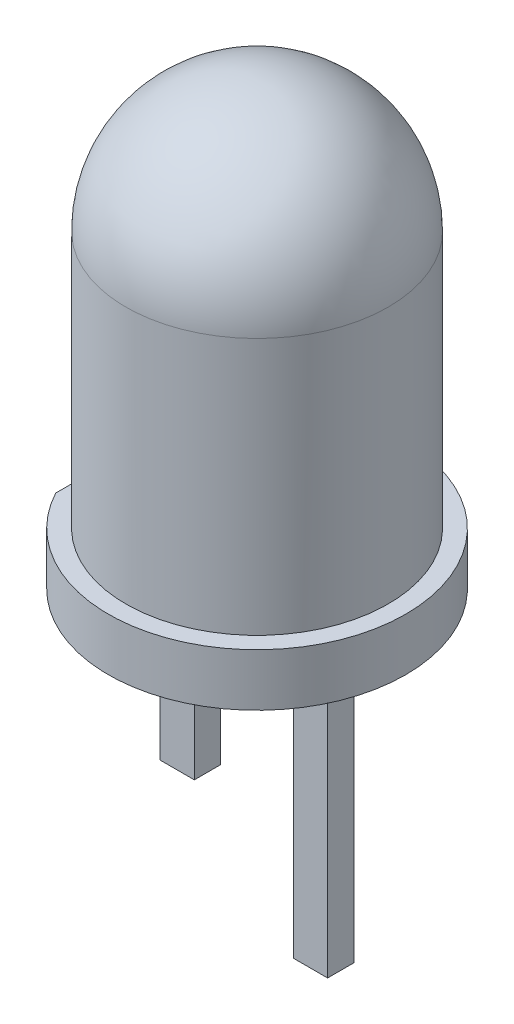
from build123d import *

# Parameters (mm, degrees)
ESQUISSE2_W             = 1.299065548
ESQUISSE2_H             = 1
ENL_V_MAT_EXTRU_1_DEPTH = 5
ESQUISSE3_W             = 0.65
ESQUISSE3_H             = 0.5
EXTRUSION1_DEPTH        = 5.5
EXTRUSION3_DEPTH        = 0.25
EXTRUSION3_2_DEPTH      = 0.25
ESQUISSE6_W             = 2.007351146
ESQUISSE6_H             = 2
ENL_V_MAT_EXTRU_2_DEPTH = 10.386929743


with BuildPart() as part:
    # Esquisse1 → R_volution1 (revolve)
    with BuildSketch(Plane.XY, mode=Mode.PRIVATE) as r_volution1_sk:
        with BuildLine():
            Line((-2.5, 5.9), (-2.5, 1))
            Line((-2.5, 1), (-2.835, 1))
            Line((-2.835, 1), (-2.835, 0))
            Line((-2.835, 0), (0, 0))
            Line((0, 0), (0, 8.4))
            ThreePointArc((0, 8.4), (-1.767766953, 7.667766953), (-2.5, 5.9))
        make_face()
    revolve(r_volution1_sk.sketch.rotate(Axis((0, 0, 0), (0, 1, 0)), 270), axis=Axis((0, 0, 0), (0, 1, 0)))

    # Esquisse2 → Enl_v. mat.-Extru.1 (cut, symmetric)
    with BuildSketch(Plane.XY):
        with Locations((-3.149532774, 0.5)):
            Rectangle(ESQUISSE2_W, ESQUISSE2_H)
    extrude(amount=ENL_V_MAT_EXTRU_1_DEPTH, both=True, mode=Mode.SUBTRACT)

    # Esquisse3 → Extrusion1 (add)
    with BuildSketch(Plane.XZ):
        with Locations((1.27, 0)):
            Rectangle(ESQUISSE3_W, ESQUISSE3_H)
        with Locations((-1.27, 0)):
            Rectangle(ESQUISSE3_W, ESQUISSE3_H)
    extrude(amount=EXTRUSION1_DEPTH)

    # Esquisse6 → Enl_v. mat.-Extru.2 (cut, through all)
    with BuildSketch(Plane.XY.offset(0.25)):
        with Locations((-1.948675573, -4.5)):
            Rectangle(ESQUISSE6_W, ESQUISSE6_H)
    extrude(amount=-ENL_V_MAT_EXTRU_2_DEPTH, mode=Mode.SUBTRACT)


with BuildPart() as body_2:
    # Esquisse5 → Extrusion3 (new, symmetric)
    with BuildSketch(Plane.XY):
        with BuildLine():
            Line((0.945, 0), (0.945, 0.23))
            Line((0.945, 0.23), (0.231099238, 0.377841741))
            Line((0.231099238, 0.377841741), (-1.292983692, 3.587552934))
            Line((-1.292983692, 3.587552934), (-0.103725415, 2.981595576))
            ThreePointArc((-0.103725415, 2.981595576), (0.234894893, 2.939718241), (0.521534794, 3.124799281))
            Line((0.521534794, 3.124799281), (0.80632764, 3.5))
            Line((0.80632764, 3.5), (1.595, 3.5))
            Line((1.595, 3.5), (1.595, 0))
            Line((1.595, 0), (0.945, 0))
        make_face()
    extrude(amount=EXTRUSION3_DEPTH, both=True)


with BuildPart() as body_3:
    # Esquisse5 → Extrusion3 2 (new, symmetric)
    with BuildSketch(Plane.XY):
        Polygon((-1.595, 0), (-1.595, 3.293272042), (-0.323998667, 0.616549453), (-0.945, 0.271653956), (-0.945, 0), align=None)
    extrude(amount=EXTRUSION3_2_DEPTH, both=True)


solid = Compound([part.part, body_2.part, body_3.part])
